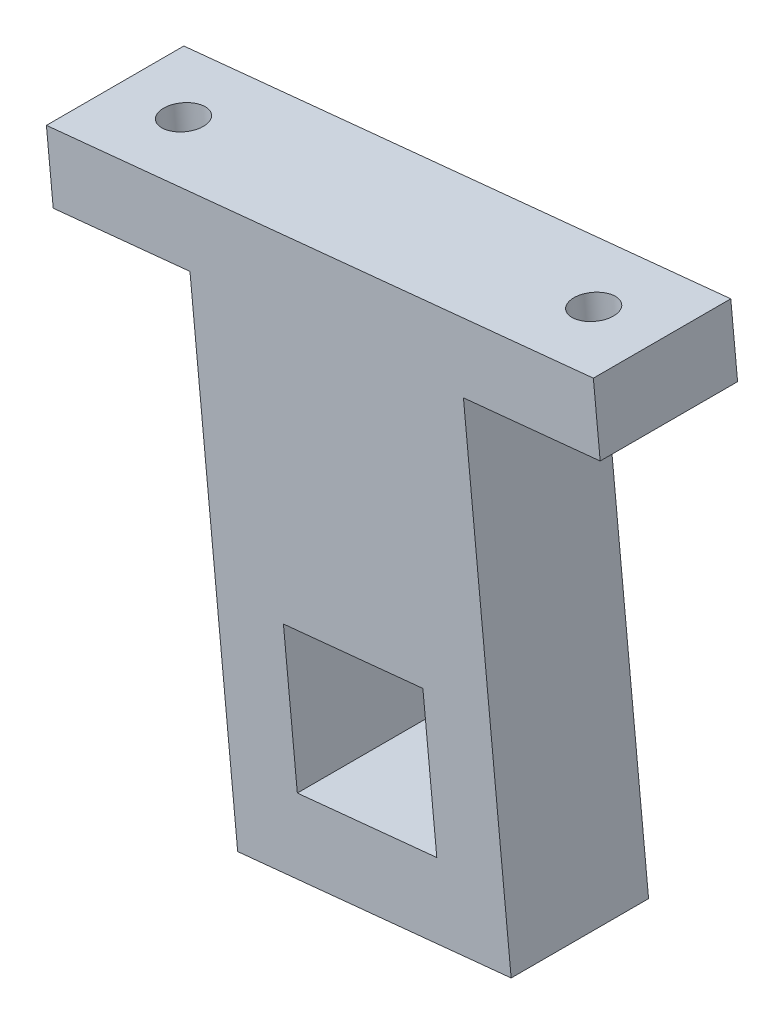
ISO-10303-21;
HEADER;
FILE_DESCRIPTION(('STEP AP214'),'2;1');
FILE_NAME('part.step','',(''),(''),'','','');
FILE_SCHEMA(('AUTOMOTIVE_DESIGN { 1 0 10303 214 1 1 1 1 }'));
ENDSEC;
DATA;
#1=APPLICATION_CONTEXT('core data for automotive mechanical design processes');
#2=APPLICATION_PROTOCOL_DEFINITION('international standard','automotive_design',2000,#1);
#3=PRODUCT_CONTEXT('',#1,'mechanical');
#4=PRODUCT('Part','Part','',(#3));
#5=PRODUCT_RELATED_PRODUCT_CATEGORY('part','',(#4));
#6=PRODUCT_DEFINITION_FORMATION('','',#4);
#7=PRODUCT_DEFINITION_CONTEXT('part definition',#1,'design');
#8=PRODUCT_DEFINITION('design','',#6,#7);
#9=PRODUCT_DEFINITION_SHAPE('','',#8);
#10=(LENGTH_UNIT() NAMED_UNIT(*) SI_UNIT(.MILLI.,.METRE.));
#11=(NAMED_UNIT(*) PLANE_ANGLE_UNIT() SI_UNIT($,.RADIAN.));
#12=(NAMED_UNIT(*) SI_UNIT($,.STERADIAN.) SOLID_ANGLE_UNIT());
#13=UNCERTAINTY_MEASURE_WITH_UNIT(LENGTH_MEASURE(1.E-05),#10,'distance_accuracy_value','');
#14=(GEOMETRIC_REPRESENTATION_CONTEXT(3) GLOBAL_UNCERTAINTY_ASSIGNED_CONTEXT((#13)) GLOBAL_UNIT_ASSIGNED_CONTEXT((#10,
#11,#12)) REPRESENTATION_CONTEXT('',''));
#15=CARTESIAN_POINT('',(0.,0.,0.));
#16=DIRECTION('',(0.,0.,1.));
#17=DIRECTION('',(1.,0.,0.));
#18=AXIS2_PLACEMENT_3D('',#15,#16,#17);
#19=CARTESIAN_POINT('',(0.,0.,10.));
#20=DIRECTION('',(0.,0.,-1.));
#21=DIRECTION('',(-1.,0.,0.));
#22=AXIS2_PLACEMENT_3D('',#19,#20,#21);
#23=PLANE('',#22);
#24=DIRECTION('',(0.995063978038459,0.0992354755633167,0.));
#25=VECTOR('',#24,1.);
#26=CARTESIAN_POINT('',(74.9791425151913,-167.604042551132,10.));
#27=LINE('',#26,#25);
#28=CARTESIAN_POINT('',(74.9791425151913,-167.604042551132,10.));
#29=VERTEX_POINT('',#28);
#30=CARTESIAN_POINT('',(84.9297822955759,-166.611687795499,10.));
#31=VERTEX_POINT('',#30);
#32=EDGE_CURVE('E187',#29,#31,#27,.T.);
#33=ORIENTED_EDGE('',*,*,#32,.T.);
#34=DIRECTION('',(0.0992354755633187,-0.995063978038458,0.));
#35=VECTOR('',#34,1.);
#36=CARTESIAN_POINT('',(84.9297822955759,-166.611687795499,10.));
#37=LINE('',#36,#35);
#38=CARTESIAN_POINT('',(88.4030239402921,-201.438927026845,10.));
#39=VERTEX_POINT('',#38);
#40=EDGE_CURVE('E191',#31,#39,#37,.T.);
#41=ORIENTED_EDGE('',*,*,#40,.T.);
#42=DIRECTION('',(0.995063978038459,0.0992354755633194,0.));
#43=VECTOR('',#42,1.);
#44=CARTESIAN_POINT('',(108.304303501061,-199.454217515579,10.));
#45=LINE('',#44,#43);
#46=CARTESIAN_POINT('',(108.304303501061,-199.454217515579,10.));
#47=VERTEX_POINT('',#46);
#48=EDGE_CURVE('E195',#39,#47,#45,.T.);
#49=ORIENTED_EDGE('',*,*,#48,.T.);
#50=DIRECTION('',(-0.0992354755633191,0.995063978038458,0.));
#51=VECTOR('',#50,1.);
#52=CARTESIAN_POINT('',(104.831061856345,-164.626978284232,10.));
#53=LINE('',#52,#51);
#54=CARTESIAN_POINT('',(104.831061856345,-164.626978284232,10.));
#55=VERTEX_POINT('',#54);
#56=EDGE_CURVE('E198',#47,#55,#53,.T.);
#57=ORIENTED_EDGE('',*,*,#56,.T.);
#58=DIRECTION('',(0.995063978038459,0.0992354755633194,0.));
#59=VECTOR('',#58,1.);
#60=CARTESIAN_POINT('',(114.78170163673,-163.634623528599,10.));
#61=LINE('',#60,#59);
#62=CARTESIAN_POINT('',(114.78170163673,-163.634623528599,10.));
#63=VERTEX_POINT('',#62);
#64=EDGE_CURVE('E201',#55,#63,#61,.T.);
#65=ORIENTED_EDGE('',*,*,#64,.T.);
#66=DIRECTION('',(-0.0992354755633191,0.995063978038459,0.));
#67=VECTOR('',#66,1.);
#68=CARTESIAN_POINT('',(114.285524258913,-158.659303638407,10.));
#69=LINE('',#68,#67);
#70=CARTESIAN_POINT('',(114.285524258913,-158.659303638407,10.));
#71=VERTEX_POINT('',#70);
#72=EDGE_CURVE('E204',#63,#71,#69,.T.);
#73=ORIENTED_EDGE('',*,*,#72,.T.);
#74=DIRECTION('',(-0.995063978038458,-0.099235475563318,0.));
#75=VECTOR('',#74,1.);
#76=CARTESIAN_POINT('',(114.285524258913,-158.659303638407,10.));
#77=LINE('',#76,#75);
#78=CARTESIAN_POINT('',(74.4829651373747,-162.62872266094,10.));
#79=VERTEX_POINT('',#78);
#80=EDGE_CURVE('E207',#71,#79,#77,.T.);
#81=ORIENTED_EDGE('',*,*,#80,.T.);
#82=DIRECTION('',(0.0992354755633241,-0.995063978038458,0.));
#83=VECTOR('',#82,1.);
#84=CARTESIAN_POINT('',(74.4829651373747,-162.62872266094,10.));
#85=LINE('',#84,#83);
#86=EDGE_CURVE('E210',#79,#29,#85,.T.);
#87=ORIENTED_EDGE('',*,*,#86,.T.);
#88=EDGE_LOOP('',(#33,#41,#49,#57,#65,#73,#81,#87));
#89=FACE_BOUND('',#88,.T.);
#90=DIRECTION('',(-0.995063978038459,-0.0992354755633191,0.));
#91=VECTOR('',#90,1.);
#92=CARTESIAN_POINT('',(101.880416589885,-184.417473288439,10.));
#93=LINE('',#92,#91);
#94=CARTESIAN_POINT('',(101.880416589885,-184.417473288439,10.));
#95=VERTEX_POINT('',#94);
#96=CARTESIAN_POINT('',(91.7307640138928,-185.429675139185,10.));
#97=VERTEX_POINT('',#96);
#98=EDGE_CURVE('E137',#95,#97,#93,.T.);
#99=ORIENTED_EDGE('',*,*,#98,.F.);
#100=DIRECTION('',(-0.0992354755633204,0.995063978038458,0.));
#101=VECTOR('',#100,1.);
#102=CARTESIAN_POINT('',(102.892618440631,-194.567125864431,10.));
#103=LINE('',#102,#101);
#104=CARTESIAN_POINT('',(102.892618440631,-194.567125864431,10.));
#105=VERTEX_POINT('',#104);
#106=EDGE_CURVE('E163',#105,#95,#103,.T.);
#107=ORIENTED_EDGE('',*,*,#106,.F.);
#108=DIRECTION('',(0.995063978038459,0.0992354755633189,0.));
#109=VECTOR('',#108,1.);
#110=CARTESIAN_POINT('',(92.7429658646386,-195.579327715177,10.));
#111=LINE('',#110,#109);
#112=CARTESIAN_POINT('',(92.7429658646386,-195.579327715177,10.));
#113=VERTEX_POINT('',#112);
#114=EDGE_CURVE('E159',#113,#105,#111,.T.);
#115=ORIENTED_EDGE('',*,*,#114,.F.);
#116=DIRECTION('',(0.0992354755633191,-0.995063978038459,0.));
#117=VECTOR('',#116,1.);
#118=CARTESIAN_POINT('',(92.7429658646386,-195.579327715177,10.));
#119=LINE('',#118,#117);
#120=EDGE_CURVE('E146',#97,#113,#119,.T.);
#121=ORIENTED_EDGE('',*,*,#120,.F.);
#122=EDGE_LOOP('',(#99,#107,#115,#121));
#123=FACE_BOUND('',#122,.T.);
#124=ADVANCED_FACE('F45',(#89,#123),#23,.F.);
#125=CARTESIAN_POINT('',(0.,0.,0.));
#126=DIRECTION('',(0.,0.,-1.));
#127=DIRECTION('',(-1.,0.,0.));
#128=AXIS2_PLACEMENT_3D('',#125,#126,#127);
#129=PLANE('',#128);
#130=DIRECTION('',(0.995063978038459,0.0992354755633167,0.));
#131=VECTOR('',#130,1.);
#132=CARTESIAN_POINT('',(74.9791425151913,-167.604042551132,0.));
#133=LINE('',#132,#131);
#134=CARTESIAN_POINT('',(74.9791425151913,-167.604042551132,0.));
#135=VERTEX_POINT('',#134);
#136=CARTESIAN_POINT('',(84.9297822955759,-166.611687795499,0.));
#137=VERTEX_POINT('',#136);
#138=EDGE_CURVE('E155',#135,#137,#133,.T.);
#139=ORIENTED_EDGE('',*,*,#138,.F.);
#140=DIRECTION('',(0.0992354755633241,-0.995063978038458,0.));
#141=VECTOR('',#140,1.);
#142=CARTESIAN_POINT('',(74.4829651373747,-162.62872266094,0.));
#143=LINE('',#142,#141);
#144=CARTESIAN_POINT('',(74.4829651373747,-162.62872266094,0.));
#145=VERTEX_POINT('',#144);
#146=EDGE_CURVE('E192',#145,#135,#143,.T.);
#147=ORIENTED_EDGE('',*,*,#146,.F.);
#148=DIRECTION('',(-0.995063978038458,-0.099235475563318,0.));
#149=VECTOR('',#148,1.);
#150=CARTESIAN_POINT('',(114.285524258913,-158.659303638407,0.));
#151=LINE('',#150,#149);
#152=CARTESIAN_POINT('',(114.285524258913,-158.659303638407,0.));
#153=VERTEX_POINT('',#152);
#154=EDGE_CURVE('E232',#153,#145,#151,.T.);
#155=ORIENTED_EDGE('',*,*,#154,.F.);
#156=DIRECTION('',(-0.0992354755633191,0.995063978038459,0.));
#157=VECTOR('',#156,1.);
#158=CARTESIAN_POINT('',(114.285524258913,-158.659303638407,0.));
#159=LINE('',#158,#157);
#160=CARTESIAN_POINT('',(114.78170163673,-163.634623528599,0.));
#161=VERTEX_POINT('',#160);
#162=EDGE_CURVE('E229',#161,#153,#159,.T.);
#163=ORIENTED_EDGE('',*,*,#162,.F.);
#164=DIRECTION('',(0.995063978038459,0.0992354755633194,0.));
#165=VECTOR('',#164,1.);
#166=CARTESIAN_POINT('',(114.78170163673,-163.634623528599,0.));
#167=LINE('',#166,#165);
#168=CARTESIAN_POINT('',(104.831061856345,-164.626978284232,0.));
#169=VERTEX_POINT('',#168);
#170=EDGE_CURVE('E226',#169,#161,#167,.T.);
#171=ORIENTED_EDGE('',*,*,#170,.F.);
#172=DIRECTION('',(-0.0992354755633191,0.995063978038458,0.));
#173=VECTOR('',#172,1.);
#174=CARTESIAN_POINT('',(104.831061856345,-164.626978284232,0.));
#175=LINE('',#174,#173);
#176=CARTESIAN_POINT('',(108.304303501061,-199.454217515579,0.));
#177=VERTEX_POINT('',#176);
#178=EDGE_CURVE('E223',#177,#169,#175,.T.);
#179=ORIENTED_EDGE('',*,*,#178,.F.);
#180=DIRECTION('',(0.995063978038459,0.0992354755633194,0.));
#181=VECTOR('',#180,1.);
#182=CARTESIAN_POINT('',(108.304303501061,-199.454217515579,0.));
#183=LINE('',#182,#181);
#184=CARTESIAN_POINT('',(88.4030239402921,-201.438927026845,0.));
#185=VERTEX_POINT('',#184);
#186=EDGE_CURVE('E220',#185,#177,#183,.T.);
#187=ORIENTED_EDGE('',*,*,#186,.F.);
#188=DIRECTION('',(0.0992354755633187,-0.995063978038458,0.));
#189=VECTOR('',#188,1.);
#190=CARTESIAN_POINT('',(84.9297822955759,-166.611687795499,0.));
#191=LINE('',#190,#189);
#192=EDGE_CURVE('E217',#137,#185,#191,.T.);
#193=ORIENTED_EDGE('',*,*,#192,.F.);
#194=EDGE_LOOP('',(#139,#147,#155,#163,#171,#179,#187,#193));
#195=FACE_BOUND('',#194,.T.);
#196=DIRECTION('',(-0.0992354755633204,0.995063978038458,0.));
#197=VECTOR('',#196,1.);
#198=CARTESIAN_POINT('',(102.892618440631,-194.567125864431,0.));
#199=LINE('',#198,#197);
#200=CARTESIAN_POINT('',(102.892618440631,-194.567125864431,0.));
#201=VERTEX_POINT('',#200);
#202=CARTESIAN_POINT('',(101.880416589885,-184.417473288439,0.));
#203=VERTEX_POINT('',#202);
#204=EDGE_CURVE('E147',#201,#203,#199,.T.);
#205=ORIENTED_EDGE('',*,*,#204,.T.);
#206=DIRECTION('',(-0.995063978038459,-0.0992354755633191,0.));
#207=VECTOR('',#206,1.);
#208=CARTESIAN_POINT('',(101.880416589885,-184.417473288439,0.));
#209=LINE('',#208,#207);
#210=CARTESIAN_POINT('',(91.7307640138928,-185.429675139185,0.));
#211=VERTEX_POINT('',#210);
#212=EDGE_CURVE('E71',#203,#211,#209,.T.);
#213=ORIENTED_EDGE('',*,*,#212,.T.);
#214=DIRECTION('',(0.0992354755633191,-0.995063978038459,0.));
#215=VECTOR('',#214,1.);
#216=CARTESIAN_POINT('',(92.7429658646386,-195.579327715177,0.));
#217=LINE('',#216,#215);
#218=CARTESIAN_POINT('',(92.7429658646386,-195.579327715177,0.));
#219=VERTEX_POINT('',#218);
#220=EDGE_CURVE('E153',#211,#219,#217,.T.);
#221=ORIENTED_EDGE('',*,*,#220,.T.);
#222=DIRECTION('',(0.995063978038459,0.0992354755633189,0.));
#223=VECTOR('',#222,1.);
#224=CARTESIAN_POINT('',(92.7429658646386,-195.579327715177,0.));
#225=LINE('',#224,#223);
#226=EDGE_CURVE('E174',#219,#201,#225,.T.);
#227=ORIENTED_EDGE('',*,*,#226,.T.);
#228=EDGE_LOOP('',(#205,#213,#221,#227));
#229=FACE_BOUND('',#228,.T.);
#230=ADVANCED_FACE('F290',(#195,#229),#129,.T.);
#231=CARTESIAN_POINT('',(74.9791425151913,-167.604042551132,10.));
#232=DIRECTION('',(-0.0992354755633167,0.995063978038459,0.));
#233=DIRECTION('',(-0.995063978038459,-0.0992354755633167,0.));
#234=AXIS2_PLACEMENT_3D('',#231,#232,#233);
#235=PLANE('',#234);
#236=CARTESIAN_POINT('',(79.9544624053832,-167.107865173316,5.));
#237=DIRECTION('',(0.0992354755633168,-0.995063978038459,0.));
#238=DIRECTION('',(0.995063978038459,0.0992354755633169,0.));
#239=AXIS2_PLACEMENT_3D('',#236,#237,#238);
#240=CIRCLE('',#239,2.75);
#241=CARTESIAN_POINT('',(82.690888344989,-166.834967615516,5.));
#242=VERTEX_POINT('',#241);
#243=EDGE_CURVE('E280',#242,#242,#240,.T.);
#244=ORIENTED_EDGE('',*,*,#243,.F.);
#245=EDGE_LOOP('',(#244));
#246=FACE_BOUND('',#245,.T.);
#247=ORIENTED_EDGE('',*,*,#138,.T.);
#248=DIRECTION('',(0.,0.,-1.));
#249=VECTOR('',#248,1.);
#250=CARTESIAN_POINT('',(84.9297822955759,-166.611687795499,10.));
#251=LINE('',#250,#249);
#252=EDGE_CURVE('E11',#31,#137,#251,.T.);
#253=ORIENTED_EDGE('',*,*,#252,.F.);
#254=ORIENTED_EDGE('',*,*,#32,.F.);
#255=DIRECTION('',(0.,0.,-1.));
#256=VECTOR('',#255,1.);
#257=CARTESIAN_POINT('',(74.9791425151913,-167.604042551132,10.));
#258=LINE('',#257,#256);
#259=EDGE_CURVE('E213',#29,#135,#258,.T.);
#260=ORIENTED_EDGE('',*,*,#259,.T.);
#261=EDGE_LOOP('',(#247,#253,#254,#260));
#262=FACE_BOUND('',#261,.T.);
#263=ADVANCED_FACE('F47',(#246,#262),#235,.F.);
#264=CARTESIAN_POINT('',(84.9297822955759,-166.611687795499,10.));
#265=DIRECTION('',(0.995063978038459,0.0992354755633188,0.));
#266=DIRECTION('',(-0.0992354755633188,0.995063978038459,0.));
#267=AXIS2_PLACEMENT_3D('',#264,#265,#266);
#268=PLANE('',#267);
#269=ORIENTED_EDGE('',*,*,#192,.T.);
#270=DIRECTION('',(0.,0.,-1.));
#271=VECTOR('',#270,1.);
#272=CARTESIAN_POINT('',(88.4030239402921,-201.438927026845,10.));
#273=LINE('',#272,#271);
#274=EDGE_CURVE('E55',#39,#185,#273,.T.);
#275=ORIENTED_EDGE('',*,*,#274,.F.);
#276=ORIENTED_EDGE('',*,*,#40,.F.);
#277=ORIENTED_EDGE('',*,*,#252,.T.);
#278=EDGE_LOOP('',(#269,#275,#276,#277));
#279=FACE_BOUND('',#278,.T.);
#280=ADVANCED_FACE('F289',(#279),#268,.F.);
#281=CARTESIAN_POINT('',(108.304303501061,-199.454217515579,10.));
#282=DIRECTION('',(-0.0992354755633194,0.995063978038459,0.));
#283=DIRECTION('',(-0.995063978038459,-0.0992354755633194,0.));
#284=AXIS2_PLACEMENT_3D('',#281,#282,#283);
#285=PLANE('',#284);
#286=ORIENTED_EDGE('',*,*,#186,.T.);
#287=DIRECTION('',(0.,0.,-1.));
#288=VECTOR('',#287,1.);
#289=CARTESIAN_POINT('',(108.304303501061,-199.454217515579,10.));
#290=LINE('',#289,#288);
#291=EDGE_CURVE('E256',#47,#177,#290,.T.);
#292=ORIENTED_EDGE('',*,*,#291,.F.);
#293=ORIENTED_EDGE('',*,*,#48,.F.);
#294=ORIENTED_EDGE('',*,*,#274,.T.);
#295=EDGE_LOOP('',(#286,#292,#293,#294));
#296=FACE_BOUND('',#295,.T.);
#297=ADVANCED_FACE('F328',(#296),#285,.F.);
#298=CARTESIAN_POINT('',(104.831061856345,-164.626978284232,10.));
#299=DIRECTION('',(-0.995063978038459,-0.0992354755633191,0.));
#300=DIRECTION('',(0.0992354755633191,-0.995063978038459,0.));
#301=AXIS2_PLACEMENT_3D('',#298,#299,#300);
#302=PLANE('',#301);
#303=ORIENTED_EDGE('',*,*,#178,.T.);
#304=DIRECTION('',(0.,0.,-1.));
#305=VECTOR('',#304,1.);
#306=CARTESIAN_POINT('',(104.831061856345,-164.626978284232,10.));
#307=LINE('',#306,#305);
#308=EDGE_CURVE('E252',#55,#169,#307,.T.);
#309=ORIENTED_EDGE('',*,*,#308,.F.);
#310=ORIENTED_EDGE('',*,*,#56,.F.);
#311=ORIENTED_EDGE('',*,*,#291,.T.);
#312=EDGE_LOOP('',(#303,#309,#310,#311));
#313=FACE_BOUND('',#312,.T.);
#314=ADVANCED_FACE('F325',(#313),#302,.F.);
#315=CARTESIAN_POINT('',(114.78170163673,-163.634623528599,10.));
#316=DIRECTION('',(-0.0992354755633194,0.995063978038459,0.));
#317=DIRECTION('',(-0.995063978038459,-0.0992354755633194,0.));
#318=AXIS2_PLACEMENT_3D('',#315,#316,#317);
#319=PLANE('',#318);
#320=CARTESIAN_POINT('',(109.806381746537,-164.130800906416,5.));
#321=DIRECTION('',(0.0992354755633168,-0.995063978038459,0.));
#322=DIRECTION('',(0.995063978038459,0.0992354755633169,0.));
#323=AXIS2_PLACEMENT_3D('',#320,#321,#322);
#324=CIRCLE('',#323,2.75);
#325=CARTESIAN_POINT('',(112.542807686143,-163.857903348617,5.));
#326=VERTEX_POINT('',#325);
#327=EDGE_CURVE('E269',#326,#326,#324,.T.);
#328=ORIENTED_EDGE('',*,*,#327,.F.);
#329=EDGE_LOOP('',(#328));
#330=FACE_BOUND('',#329,.T.);
#331=ORIENTED_EDGE('',*,*,#170,.T.);
#332=DIRECTION('',(0.,0.,-1.));
#333=VECTOR('',#332,1.);
#334=CARTESIAN_POINT('',(114.78170163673,-163.634623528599,10.));
#335=LINE('',#334,#333);
#336=EDGE_CURVE('E248',#63,#161,#335,.T.);
#337=ORIENTED_EDGE('',*,*,#336,.F.);
#338=ORIENTED_EDGE('',*,*,#64,.F.);
#339=ORIENTED_EDGE('',*,*,#308,.T.);
#340=EDGE_LOOP('',(#331,#337,#338,#339));
#341=FACE_BOUND('',#340,.T.);
#342=ADVANCED_FACE('F321',(#330,#341),#319,.F.);
#343=CARTESIAN_POINT('',(114.285524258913,-158.659303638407,10.));
#344=DIRECTION('',(-0.995063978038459,-0.0992354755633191,0.));
#345=DIRECTION('',(0.0992354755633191,-0.995063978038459,0.));
#346=AXIS2_PLACEMENT_3D('',#343,#344,#345);
#347=PLANE('',#346);
#348=ORIENTED_EDGE('',*,*,#162,.T.);
#349=DIRECTION('',(0.,0.,-1.));
#350=VECTOR('',#349,1.);
#351=CARTESIAN_POINT('',(114.285524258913,-158.659303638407,10.));
#352=LINE('',#351,#350);
#353=EDGE_CURVE('E244',#71,#153,#352,.T.);
#354=ORIENTED_EDGE('',*,*,#353,.F.);
#355=ORIENTED_EDGE('',*,*,#72,.F.);
#356=ORIENTED_EDGE('',*,*,#336,.T.);
#357=EDGE_LOOP('',(#348,#354,#355,#356));
#358=FACE_BOUND('',#357,.T.);
#359=ADVANCED_FACE('F316',(#358),#347,.F.);
#360=CARTESIAN_POINT('',(114.285524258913,-158.659303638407,10.));
#361=DIRECTION('',(0.099235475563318,-0.995063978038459,0.));
#362=DIRECTION('',(0.995063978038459,0.099235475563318,0.));
#363=AXIS2_PLACEMENT_3D('',#360,#361,#362);
#364=PLANE('',#363);
#365=CARTESIAN_POINT('',(79.4582850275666,-162.132545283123,5.));
#366=DIRECTION('',(0.099235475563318,-0.995063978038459,0.));
#367=DIRECTION('',(0.995063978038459,0.099235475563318,0.));
#368=AXIS2_PLACEMENT_3D('',#365,#366,#367);
#369=CIRCLE('',#368,1.45);
#370=CARTESIAN_POINT('',(80.9011277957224,-161.988653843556,5.));
#371=VERTEX_POINT('',#370);
#372=EDGE_CURVE('E49',#371,#371,#369,.T.);
#373=ORIENTED_EDGE('',*,*,#372,.T.);
#374=EDGE_LOOP('',(#373));
#375=FACE_BOUND('',#374,.T.);
#376=CARTESIAN_POINT('',(109.31020436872,-159.155481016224,5.));
#377=DIRECTION('',(0.099235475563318,-0.995063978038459,0.));
#378=DIRECTION('',(0.995063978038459,0.099235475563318,0.));
#379=AXIS2_PLACEMENT_3D('',#376,#377,#378);
#380=CIRCLE('',#379,1.45);
#381=CARTESIAN_POINT('',(110.753047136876,-159.011589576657,5.));
#382=VERTEX_POINT('',#381);
#383=EDGE_CURVE('E171',#382,#382,#380,.T.);
#384=ORIENTED_EDGE('',*,*,#383,.T.);
#385=EDGE_LOOP('',(#384));
#386=FACE_BOUND('',#385,.T.);
#387=ORIENTED_EDGE('',*,*,#154,.T.);
#388=DIRECTION('',(0.,0.,-1.));
#389=VECTOR('',#388,1.);
#390=CARTESIAN_POINT('',(74.4829651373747,-162.62872266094,10.));
#391=LINE('',#390,#389);
#392=EDGE_CURVE('E240',#79,#145,#391,.T.);
#393=ORIENTED_EDGE('',*,*,#392,.F.);
#394=ORIENTED_EDGE('',*,*,#80,.F.);
#395=ORIENTED_EDGE('',*,*,#353,.T.);
#396=EDGE_LOOP('',(#387,#393,#394,#395));
#397=FACE_BOUND('',#396,.T.);
#398=ADVANCED_FACE('F311',(#375,#386,#397),#364,.F.);
#399=CARTESIAN_POINT('',(74.4829651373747,-162.62872266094,10.));
#400=DIRECTION('',(0.995063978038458,0.0992354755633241,0.));
#401=DIRECTION('',(-0.0992354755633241,0.995063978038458,0.));
#402=AXIS2_PLACEMENT_3D('',#399,#400,#401);
#403=PLANE('',#402);
#404=ORIENTED_EDGE('',*,*,#146,.T.);
#405=ORIENTED_EDGE('',*,*,#259,.F.);
#406=ORIENTED_EDGE('',*,*,#86,.F.);
#407=ORIENTED_EDGE('',*,*,#392,.T.);
#408=EDGE_LOOP('',(#404,#405,#406,#407));
#409=FACE_BOUND('',#408,.T.);
#410=ADVANCED_FACE('F309',(#409),#403,.F.);
#411=CARTESIAN_POINT('',(101.880416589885,-184.417473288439,10.));
#412=DIRECTION('',(0.0992354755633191,-0.995063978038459,0.));
#413=DIRECTION('',(0.995063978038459,0.0992354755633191,0.));
#414=AXIS2_PLACEMENT_3D('',#411,#412,#413);
#415=PLANE('',#414);
#416=ORIENTED_EDGE('',*,*,#212,.F.);
#417=DIRECTION('',(0.,0.,-1.));
#418=VECTOR('',#417,1.);
#419=CARTESIAN_POINT('',(101.880416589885,-184.417473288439,10.));
#420=LINE('',#419,#418);
#421=EDGE_CURVE('E141',#95,#203,#420,.T.);
#422=ORIENTED_EDGE('',*,*,#421,.F.);
#423=ORIENTED_EDGE('',*,*,#98,.T.);
#424=DIRECTION('',(0.,0.,-1.));
#425=VECTOR('',#424,1.);
#426=CARTESIAN_POINT('',(91.7307640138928,-185.429675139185,10.));
#427=LINE('',#426,#425);
#428=EDGE_CURVE('E140',#97,#211,#427,.T.);
#429=ORIENTED_EDGE('',*,*,#428,.T.);
#430=EDGE_LOOP('',(#416,#422,#423,#429));
#431=FACE_BOUND('',#430,.T.);
#432=ADVANCED_FACE('F139',(#431),#415,.T.);
#433=CARTESIAN_POINT('',(92.7429658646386,-195.579327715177,10.));
#434=DIRECTION('',(0.995063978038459,0.0992354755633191,0.));
#435=DIRECTION('',(-0.0992354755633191,0.995063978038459,0.));
#436=AXIS2_PLACEMENT_3D('',#433,#434,#435);
#437=PLANE('',#436);
#438=ORIENTED_EDGE('',*,*,#220,.F.);
#439=ORIENTED_EDGE('',*,*,#428,.F.);
#440=ORIENTED_EDGE('',*,*,#120,.T.);
#441=DIRECTION('',(0.,0.,-1.));
#442=VECTOR('',#441,1.);
#443=CARTESIAN_POINT('',(92.7429658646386,-195.579327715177,10.));
#444=LINE('',#443,#442);
#445=EDGE_CURVE('E156',#113,#219,#444,.T.);
#446=ORIENTED_EDGE('',*,*,#445,.T.);
#447=EDGE_LOOP('',(#438,#439,#440,#446));
#448=FACE_BOUND('',#447,.T.);
#449=ADVANCED_FACE('F150',(#448),#437,.T.);
#450=CARTESIAN_POINT('',(92.7429658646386,-195.579327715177,10.));
#451=DIRECTION('',(-0.0992354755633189,0.995063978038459,0.));
#452=DIRECTION('',(-0.995063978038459,-0.0992354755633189,0.));
#453=AXIS2_PLACEMENT_3D('',#450,#451,#452);
#454=PLANE('',#453);
#455=ORIENTED_EDGE('',*,*,#226,.F.);
#456=ORIENTED_EDGE('',*,*,#445,.F.);
#457=ORIENTED_EDGE('',*,*,#114,.T.);
#458=DIRECTION('',(0.,0.,-1.));
#459=VECTOR('',#458,1.);
#460=CARTESIAN_POINT('',(102.892618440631,-194.567125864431,10.));
#461=LINE('',#460,#459);
#462=EDGE_CURVE('E63',#105,#201,#461,.T.);
#463=ORIENTED_EDGE('',*,*,#462,.T.);
#464=EDGE_LOOP('',(#455,#456,#457,#463));
#465=FACE_BOUND('',#464,.T.);
#466=ADVANCED_FACE('F376',(#465),#454,.T.);
#467=CARTESIAN_POINT('',(102.892618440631,-194.567125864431,10.));
#468=DIRECTION('',(-0.995063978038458,-0.0992354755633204,0.));
#469=DIRECTION('',(0.0992354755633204,-0.995063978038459,0.));
#470=AXIS2_PLACEMENT_3D('',#467,#468,#469);
#471=PLANE('',#470);
#472=ORIENTED_EDGE('',*,*,#204,.F.);
#473=ORIENTED_EDGE('',*,*,#462,.F.);
#474=ORIENTED_EDGE('',*,*,#106,.T.);
#475=ORIENTED_EDGE('',*,*,#421,.T.);
#476=EDGE_LOOP('',(#472,#473,#474,#475));
#477=FACE_BOUND('',#476,.T.);
#478=ADVANCED_FACE('F370',(#477),#471,.T.);
#479=CARTESIAN_POINT('',(109.806381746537,-164.130800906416,5.));
#480=DIRECTION('',(0.0992354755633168,-0.995063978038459,0.));
#481=DIRECTION('',(0.995063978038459,0.0992354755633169,0.));
#482=AXIS2_PLACEMENT_3D('',#479,#480,#481);
#483=CYLINDRICAL_SURFACE('',#482,1.45);
#484=CARTESIAN_POINT('',(109.677375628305,-162.837217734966,5.));
#485=DIRECTION('',(0.0992354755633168,-0.995063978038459,0.));
#486=DIRECTION('',(0.995063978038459,0.0992354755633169,0.));
#487=AXIS2_PLACEMENT_3D('',#484,#485,#486);
#488=CIRCLE('',#487,1.45);
#489=CARTESIAN_POINT('',(111.12021839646,-162.693326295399,5.));
#490=VERTEX_POINT('',#489);
#491=EDGE_CURVE('E264',#490,#490,#488,.T.);
#492=CARTESIAN_POINT('',(111.12021839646,-162.693326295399,5.));
#493=CARTESIAN_POINT('',(111.11639369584,-162.654974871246,5.));
#494=CARTESIAN_POINT('',(111.112568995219,-162.616623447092,5.));
#495=CARTESIAN_POINT('',(111.104919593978,-162.539920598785,5.));
#496=CARTESIAN_POINT('',(111.101094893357,-162.501569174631,5.));
#497=CARTESIAN_POINT('',(111.093445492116,-162.424866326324,5.));
#498=CARTESIAN_POINT('',(111.089620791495,-162.386514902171,5.));
#499=CARTESIAN_POINT('',(111.081971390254,-162.309812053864,5.));
#500=CARTESIAN_POINT('',(111.078146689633,-162.27146062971,5.));
#501=CARTESIAN_POINT('',(111.070497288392,-162.194757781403,5.));
#502=CARTESIAN_POINT('',(111.066672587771,-162.156406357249,5.));
#503=CARTESIAN_POINT('',(111.05902318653,-162.079703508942,5.));
#504=CARTESIAN_POINT('',(111.055198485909,-162.041352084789,5.));
#505=CARTESIAN_POINT('',(111.047549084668,-161.964649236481,5.));
#506=CARTESIAN_POINT('',(111.043724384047,-161.926297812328,5.));
#507=CARTESIAN_POINT('',(111.036074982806,-161.849594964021,5.));
#508=CARTESIAN_POINT('',(111.032250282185,-161.811243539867,5.));
#509=CARTESIAN_POINT('',(111.024600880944,-161.73454069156,5.));
#510=CARTESIAN_POINT('',(111.020776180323,-161.696189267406,5.));
#511=CARTESIAN_POINT('',(111.013126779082,-161.619486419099,5.));
#512=CARTESIAN_POINT('',(111.009302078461,-161.581134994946,5.));
#513=CARTESIAN_POINT('',(111.00165267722,-161.504432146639,5.));
#514=CARTESIAN_POINT('',(110.997827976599,-161.466080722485,5.));
#515=CARTESIAN_POINT('',(110.990178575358,-161.389377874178,5.));
#516=CARTESIAN_POINT('',(110.986353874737,-161.351026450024,5.));
#517=CARTESIAN_POINT('',(110.978704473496,-161.274323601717,5.));
#518=CARTESIAN_POINT('',(110.974879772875,-161.235972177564,5.));
#519=CARTESIAN_POINT('',(110.967230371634,-161.159269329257,5.));
#520=CARTESIAN_POINT('',(110.963405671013,-161.120917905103,5.));
#521=CARTESIAN_POINT('',(110.955756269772,-161.044215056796,5.));
#522=CARTESIAN_POINT('',(110.951931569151,-161.005863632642,5.));
#523=CARTESIAN_POINT('',(110.94428216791,-160.929160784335,5.));
#524=CARTESIAN_POINT('',(110.940457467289,-160.890809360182,5.));
#525=CARTESIAN_POINT('',(110.932808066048,-160.814106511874,5.));
#526=CARTESIAN_POINT('',(110.928983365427,-160.775755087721,5.));
#527=CARTESIAN_POINT('',(110.921333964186,-160.699052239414,5.));
#528=CARTESIAN_POINT('',(110.917509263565,-160.66070081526,5.));
#529=CARTESIAN_POINT('',(110.909859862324,-160.583997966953,5.));
#530=CARTESIAN_POINT('',(110.906035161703,-160.545646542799,5.));
#531=CARTESIAN_POINT('',(110.898385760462,-160.468943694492,5.));
#532=CARTESIAN_POINT('',(110.894561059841,-160.430592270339,5.));
#533=CARTESIAN_POINT('',(110.8869116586,-160.353889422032,5.));
#534=CARTESIAN_POINT('',(110.883086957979,-160.315537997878,5.));
#535=CARTESIAN_POINT('',(110.875437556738,-160.238835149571,5.));
#536=CARTESIAN_POINT('',(110.871612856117,-160.200483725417,5.));
#537=CARTESIAN_POINT('',(110.863963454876,-160.12378087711,5.));
#538=CARTESIAN_POINT('',(110.860138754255,-160.085429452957,5.));
#539=CARTESIAN_POINT('',(110.852489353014,-160.008726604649,5.));
#540=CARTESIAN_POINT('',(110.848664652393,-159.970375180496,5.));
#541=CARTESIAN_POINT('',(110.841015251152,-159.893672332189,5.));
#542=CARTESIAN_POINT('',(110.837190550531,-159.855320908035,5.));
#543=CARTESIAN_POINT('',(110.82954114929,-159.778618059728,5.));
#544=CARTESIAN_POINT('',(110.825716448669,-159.740266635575,5.));
#545=CARTESIAN_POINT('',(110.818067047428,-159.663563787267,5.));
#546=CARTESIAN_POINT('',(110.814242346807,-159.625212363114,5.));
#547=CARTESIAN_POINT('',(110.806592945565,-159.548509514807,5.));
#548=CARTESIAN_POINT('',(110.802768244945,-159.510158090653,5.));
#549=CARTESIAN_POINT('',(110.795118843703,-159.433455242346,5.));
#550=CARTESIAN_POINT('',(110.791294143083,-159.395103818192,5.));
#551=CARTESIAN_POINT('',(110.783644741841,-159.318400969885,5.));
#552=CARTESIAN_POINT('',(110.779820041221,-159.280049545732,5.));
#553=CARTESIAN_POINT('',(110.772170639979,-159.203346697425,5.));
#554=CARTESIAN_POINT('',(110.768345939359,-159.164995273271,5.));
#555=CARTESIAN_POINT('',(110.760696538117,-159.088292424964,5.));
#556=CARTESIAN_POINT('',(110.756871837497,-159.04994100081,5.));
#557=CARTESIAN_POINT('',(110.753047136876,-159.011589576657,5.));
#558=B_SPLINE_CURVE_WITH_KNOTS('',3,(#492,#493,#494,#495,#496,#497,#498,#499,#500,#501,#502,
#503,#504,#505,#506,#507,#508,#509,#510,#511,#512,#513,#514,#515,#516,#517,#518,#519,#520,#521,
#522,#523,#524,#525,#526,#527,#528,#529,#530,#531,#532,#533,#534,#535,#536,#537,#538,#539,#540,
#541,#542,#543,#544,#545,#546,#547,#548,#549,#550,#551,#552,#553,#554,#555,#556,#557),
.UNSPECIFIED.,.F.,.F.,(4,2,2,2,2,2,2,2,2,2,2,2,2,2,2,2,2,2,2,2,2,2,2,2,2,2,2,2,2,2,2,2,4),(0.,
0.115625,0.231249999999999,0.346874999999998,0.462499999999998,0.578124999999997,
0.693750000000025,0.809375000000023,0.925000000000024,1.04062500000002,1.15625000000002,
1.27187500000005,1.38750000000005,1.50312500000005,1.61875000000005,1.73437500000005,
1.85000000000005,1.96562500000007,2.08125000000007,2.19687500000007,2.31250000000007,
2.42812500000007,2.5437500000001,2.6593750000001,2.7750000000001,2.8906250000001,
3.0062500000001,3.12187500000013,3.23750000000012,3.35312500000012,3.46875000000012,
3.58437500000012,3.70000000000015),.UNSPECIFIED.);
#559=EDGE_CURVE('BSEAM361',#490,#382,#558,.T.);
#560=ORIENTED_EDGE('',*,*,#491,.T.);
#561=ORIENTED_EDGE('',*,*,#383,.F.);
#562=ORIENTED_EDGE('',*,*,#559,.T.);
#563=ORIENTED_EDGE('',*,*,#559,.F.);
#564=EDGE_LOOP('',(#560,#562,#561,#563));
#565=FACE_BOUND('',#564,.T.);
#566=ADVANCED_FACE('F361',(#565),#483,.F.);
#567=CARTESIAN_POINT('',(109.806381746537,-164.130800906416,5.));
#568=DIRECTION('',(0.0992354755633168,-0.995063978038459,0.));
#569=DIRECTION('',(0.995063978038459,0.0992354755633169,0.));
#570=AXIS2_PLACEMENT_3D('',#567,#568,#569);
#571=CONICAL_SURFACE('',#570,2.75,0.785398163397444);
#572=CARTESIAN_POINT('',(111.12021839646,-162.693326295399,5.));
#573=CARTESIAN_POINT('',(111.135037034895,-162.70545730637,5.));
#574=CARTESIAN_POINT('',(111.149855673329,-162.717588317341,5.));
#575=CARTESIAN_POINT('',(111.179492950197,-162.741850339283,5.));
#576=CARTESIAN_POINT('',(111.194311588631,-162.753981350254,5.));
#577=CARTESIAN_POINT('',(111.2239488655,-162.778243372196,5.));
#578=CARTESIAN_POINT('',(111.238767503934,-162.790374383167,5.));
#579=CARTESIAN_POINT('',(111.268404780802,-162.814636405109,5.));
#580=CARTESIAN_POINT('',(111.283223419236,-162.82676741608,5.));
#581=CARTESIAN_POINT('',(111.312860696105,-162.851029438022,5.));
#582=CARTESIAN_POINT('',(111.327679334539,-162.863160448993,5.));
#583=CARTESIAN_POINT('',(111.357316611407,-162.887422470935,5.));
#584=CARTESIAN_POINT('',(111.372135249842,-162.899553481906,5.));
#585=CARTESIAN_POINT('',(111.40177252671,-162.923815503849,5.));
#586=CARTESIAN_POINT('',(111.416591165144,-162.93594651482,5.));
#587=CARTESIAN_POINT('',(111.446228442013,-162.960208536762,5.));
#588=CARTESIAN_POINT('',(111.461047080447,-162.972339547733,5.));
#589=CARTESIAN_POINT('',(111.490684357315,-162.996601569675,5.));
#590=CARTESIAN_POINT('',(111.505502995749,-163.008732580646,5.));
#591=CARTESIAN_POINT('',(111.535140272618,-163.032994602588,5.));
#592=CARTESIAN_POINT('',(111.549958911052,-163.045125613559,5.));
#593=CARTESIAN_POINT('',(111.57959618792,-163.069387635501,5.));
#594=CARTESIAN_POINT('',(111.594414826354,-163.081518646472,5.));
#595=CARTESIAN_POINT('',(111.624052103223,-163.105780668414,5.));
#596=CARTESIAN_POINT('',(111.638870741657,-163.117911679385,5.));
#597=CARTESIAN_POINT('',(111.668508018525,-163.142173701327,5.));
#598=CARTESIAN_POINT('',(111.68332665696,-163.154304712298,5.));
#599=CARTESIAN_POINT('',(111.712963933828,-163.17856673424,5.));
#600=CARTESIAN_POINT('',(111.727782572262,-163.190697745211,5.));
#601=CARTESIAN_POINT('',(111.757419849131,-163.214959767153,5.));
#602=CARTESIAN_POINT('',(111.772238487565,-163.227090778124,5.));
#603=CARTESIAN_POINT('',(111.801875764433,-163.251352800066,5.));
#604=CARTESIAN_POINT('',(111.816694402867,-163.263483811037,5.));
#605=CARTESIAN_POINT('',(111.846331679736,-163.287745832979,5.));
#606=CARTESIAN_POINT('',(111.86115031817,-163.29987684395,5.));
#607=CARTESIAN_POINT('',(111.890787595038,-163.324138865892,5.));
#608=CARTESIAN_POINT('',(111.905606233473,-163.336269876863,5.));
#609=CARTESIAN_POINT('',(111.935243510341,-163.360531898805,5.));
#610=CARTESIAN_POINT('',(111.950062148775,-163.372662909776,5.));
#611=CARTESIAN_POINT('',(111.979699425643,-163.396924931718,5.));
#612=CARTESIAN_POINT('',(111.994518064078,-163.409055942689,5.));
#613=CARTESIAN_POINT('',(112.024155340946,-163.433317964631,5.));
#614=CARTESIAN_POINT('',(112.03897397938,-163.445448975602,5.));
#615=CARTESIAN_POINT('',(112.068611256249,-163.469710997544,5.));
#616=CARTESIAN_POINT('',(112.083429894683,-163.481842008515,5.));
#617=CARTESIAN_POINT('',(112.113067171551,-163.506104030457,5.));
#618=CARTESIAN_POINT('',(112.127885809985,-163.518235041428,5.));
#619=CARTESIAN_POINT('',(112.157523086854,-163.54249706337,5.));
#620=CARTESIAN_POINT('',(112.172341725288,-163.554628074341,5.));
#621=CARTESIAN_POINT('',(112.201979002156,-163.578890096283,5.));
#622=CARTESIAN_POINT('',(112.216797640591,-163.591021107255,5.));
#623=CARTESIAN_POINT('',(112.246434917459,-163.615283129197,5.));
#624=CARTESIAN_POINT('',(112.261253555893,-163.627414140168,5.));
#625=CARTESIAN_POINT('',(112.290890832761,-163.65167616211,5.));
#626=CARTESIAN_POINT('',(112.305709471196,-163.663807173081,5.));
#627=CARTESIAN_POINT('',(112.335346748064,-163.688069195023,5.));
#628=CARTESIAN_POINT('',(112.350165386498,-163.700200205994,5.));
#629=CARTESIAN_POINT('',(112.379802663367,-163.724462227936,5.));
#630=CARTESIAN_POINT('',(112.394621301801,-163.736593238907,5.));
#631=CARTESIAN_POINT('',(112.424258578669,-163.760855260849,5.));
#632=CARTESIAN_POINT('',(112.439077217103,-163.77298627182,5.));
#633=CARTESIAN_POINT('',(112.468714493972,-163.797248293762,5.));
#634=CARTESIAN_POINT('',(112.483533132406,-163.809379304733,5.));
#635=CARTESIAN_POINT('',(112.513170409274,-163.833641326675,5.));
#636=CARTESIAN_POINT('',(112.527989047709,-163.845772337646,5.));
#637=CARTESIAN_POINT('',(112.542807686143,-163.857903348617,5.));
#638=B_SPLINE_CURVE_WITH_KNOTS('',3,(#572,#573,#574,#575,#576,#577,#578,#579,#580,#581,#582,
#583,#584,#585,#586,#587,#588,#589,#590,#591,#592,#593,#594,#595,#596,#597,#598,#599,#600,#601,
#602,#603,#604,#605,#606,#607,#608,#609,#610,#611,#612,#613,#614,#615,#616,#617,#618,#619,#620,
#621,#622,#623,#624,#625,#626,#627,#628,#629,#630,#631,#632,#633,#634,#635,#636,#637),
.UNSPECIFIED.,.F.,.F.,(4,2,2,2,2,2,2,2,2,2,2,2,2,2,2,2,2,2,2,2,2,2,2,2,2,2,2,2,2,2,2,2,4),(0.,
0.0574524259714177,0.114904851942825,0.172357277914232,0.229809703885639,0.287262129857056,
0.344714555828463,0.40216698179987,0.459619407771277,0.517071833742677,0.574524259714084,
0.631976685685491,0.689429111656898,0.746881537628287,0.804333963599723,0.86178638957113,
0.919238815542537,0.976691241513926,1.03414366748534,1.09159609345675,1.14904851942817,
1.20650094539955,1.26395337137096,1.32140579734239,1.37885822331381,1.43631064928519,
1.4937630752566,1.55121550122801,1.60866792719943,1.66612035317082,1.72357277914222,
1.78102520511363,1.83847763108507),.UNSPECIFIED.);
#639=EDGE_CURVE('BSEAM358',#490,#326,#638,.T.);
#640=ORIENTED_EDGE('',*,*,#491,.F.);
#641=ORIENTED_EDGE('',*,*,#327,.T.);
#642=ORIENTED_EDGE('',*,*,#639,.T.);
#643=ORIENTED_EDGE('',*,*,#639,.F.);
#644=EDGE_LOOP('',(#640,#642,#641,#643));
#645=FACE_BOUND('',#644,.T.);
#646=ADVANCED_FACE('F358',(#645),#571,.F.);
#647=CARTESIAN_POINT('',(79.9544624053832,-167.107865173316,5.));
#648=DIRECTION('',(0.0992354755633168,-0.995063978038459,0.));
#649=DIRECTION('',(0.995063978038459,0.0992354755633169,0.));
#650=AXIS2_PLACEMENT_3D('',#647,#648,#649);
#651=CYLINDRICAL_SURFACE('',#650,1.45);
#652=CARTESIAN_POINT('',(79.8254562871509,-165.814282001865,5.));
#653=DIRECTION('',(0.0992354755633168,-0.995063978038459,0.));
#654=DIRECTION('',(0.995063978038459,0.0992354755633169,0.));
#655=AXIS2_PLACEMENT_3D('',#652,#653,#654);
#656=CIRCLE('',#655,1.45);
#657=CARTESIAN_POINT('',(81.2682990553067,-165.670390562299,5.));
#658=VERTEX_POINT('',#657);
#659=EDGE_CURVE('E276',#658,#658,#656,.T.);
#660=CARTESIAN_POINT('',(81.2682990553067,-165.670390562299,5.));
#661=CARTESIAN_POINT('',(81.264474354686,-165.632039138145,5.));
#662=CARTESIAN_POINT('',(81.2606496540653,-165.593687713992,5.));
#663=CARTESIAN_POINT('',(81.253000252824,-165.516984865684,5.));
#664=CARTESIAN_POINT('',(81.2491755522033,-165.478633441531,5.));
#665=CARTESIAN_POINT('',(81.241526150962,-165.401930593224,5.));
#666=CARTESIAN_POINT('',(81.2377014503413,-165.36357916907,5.));
#667=CARTESIAN_POINT('',(81.2300520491,-165.286876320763,5.));
#668=CARTESIAN_POINT('',(81.2262273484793,-165.248524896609,5.));
#669=CARTESIAN_POINT('',(81.218577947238,-165.171822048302,5.));
#670=CARTESIAN_POINT('',(81.2147532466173,-165.133470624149,5.));
#671=CARTESIAN_POINT('',(81.207103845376,-165.056767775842,5.));
#672=CARTESIAN_POINT('',(81.2032791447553,-165.018416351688,5.));
#673=CARTESIAN_POINT('',(81.195629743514,-164.941713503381,5.));
#674=CARTESIAN_POINT('',(81.1918050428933,-164.903362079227,5.));
#675=CARTESIAN_POINT('',(81.184155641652,-164.82665923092,5.));
#676=CARTESIAN_POINT('',(81.1803309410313,-164.788307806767,5.));
#677=CARTESIAN_POINT('',(81.1726815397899,-164.71160495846,5.));
#678=CARTESIAN_POINT('',(81.1688568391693,-164.673253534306,5.));
#679=CARTESIAN_POINT('',(81.1612074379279,-164.596550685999,5.));
#680=CARTESIAN_POINT('',(81.1573827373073,-164.558199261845,5.));
#681=CARTESIAN_POINT('',(81.1497333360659,-164.481496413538,5.));
#682=CARTESIAN_POINT('',(81.1459086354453,-164.443144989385,5.));
#683=CARTESIAN_POINT('',(81.1382592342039,-164.366442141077,5.));
#684=CARTESIAN_POINT('',(81.1344345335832,-164.328090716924,5.));
#685=CARTESIAN_POINT('',(81.1267851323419,-164.251387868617,5.));
#686=CARTESIAN_POINT('',(81.1229604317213,-164.213036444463,5.));
#687=CARTESIAN_POINT('',(81.1153110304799,-164.136333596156,5.));
#688=CARTESIAN_POINT('',(81.1114863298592,-164.097982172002,5.));
#689=CARTESIAN_POINT('',(81.1038369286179,-164.021279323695,5.));
#690=CARTESIAN_POINT('',(81.1000122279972,-163.982927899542,5.));
#691=CARTESIAN_POINT('',(81.0923628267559,-163.906225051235,5.));
#692=CARTESIAN_POINT('',(81.0885381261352,-163.867873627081,5.));
#693=CARTESIAN_POINT('',(81.0808887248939,-163.791170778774,5.));
#694=CARTESIAN_POINT('',(81.0770640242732,-163.75281935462,5.));
#695=CARTESIAN_POINT('',(81.0694146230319,-163.676116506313,5.));
#696=CARTESIAN_POINT('',(81.0655899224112,-163.63776508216,5.));
#697=CARTESIAN_POINT('',(81.0579405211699,-163.561062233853,5.));
#698=CARTESIAN_POINT('',(81.0541158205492,-163.522710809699,5.));
#699=CARTESIAN_POINT('',(81.0464664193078,-163.446007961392,5.));
#700=CARTESIAN_POINT('',(81.0426417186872,-163.407656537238,5.));
#701=CARTESIAN_POINT('',(81.0349923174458,-163.330953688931,5.));
#702=CARTESIAN_POINT('',(81.0311676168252,-163.292602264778,5.));
#703=CARTESIAN_POINT('',(81.0235182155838,-163.21589941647,5.));
#704=CARTESIAN_POINT('',(81.0196935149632,-163.177547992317,5.));
#705=CARTESIAN_POINT('',(81.0120441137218,-163.10084514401,5.));
#706=CARTESIAN_POINT('',(81.0082194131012,-163.062493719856,5.));
#707=CARTESIAN_POINT('',(81.0005700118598,-162.985790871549,5.));
#708=CARTESIAN_POINT('',(80.9967453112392,-162.947439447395,5.));
#709=CARTESIAN_POINT('',(80.9890959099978,-162.870736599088,5.));
#710=CARTESIAN_POINT('',(80.9852712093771,-162.832385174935,5.));
#711=CARTESIAN_POINT('',(80.9776218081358,-162.755682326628,5.));
#712=CARTESIAN_POINT('',(80.9737971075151,-162.717330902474,5.));
#713=CARTESIAN_POINT('',(80.9661477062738,-162.640628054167,5.));
#714=CARTESIAN_POINT('',(80.9623230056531,-162.602276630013,5.));
#715=CARTESIAN_POINT('',(80.9546736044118,-162.525573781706,5.));
#716=CARTESIAN_POINT('',(80.9508489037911,-162.487222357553,5.));
#717=CARTESIAN_POINT('',(80.9431995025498,-162.410519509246,5.));
#718=CARTESIAN_POINT('',(80.9393748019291,-162.372168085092,5.));
#719=CARTESIAN_POINT('',(80.9317254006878,-162.295465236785,5.));
#720=CARTESIAN_POINT('',(80.9279007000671,-162.257113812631,5.));
#721=CARTESIAN_POINT('',(80.9202512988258,-162.180410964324,5.));
#722=CARTESIAN_POINT('',(80.9164265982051,-162.142059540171,5.));
#723=CARTESIAN_POINT('',(80.9087771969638,-162.065356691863,5.));
#724=CARTESIAN_POINT('',(80.9049524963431,-162.02700526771,5.));
#725=CARTESIAN_POINT('',(80.9011277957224,-161.988653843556,5.));
#726=B_SPLINE_CURVE_WITH_KNOTS('',3,(#660,#661,#662,#663,#664,#665,#666,#667,#668,#669,#670,
#671,#672,#673,#674,#675,#676,#677,#678,#679,#680,#681,#682,#683,#684,#685,#686,#687,#688,#689,
#690,#691,#692,#693,#694,#695,#696,#697,#698,#699,#700,#701,#702,#703,#704,#705,#706,#707,#708,
#709,#710,#711,#712,#713,#714,#715,#716,#717,#718,#719,#720,#721,#722,#723,#724,#725),
.UNSPECIFIED.,.F.,.F.,(4,2,2,2,2,2,2,2,2,2,2,2,2,2,2,2,2,2,2,2,2,2,2,2,2,2,2,2,2,2,2,2,4),(0.,
0.115625,0.231249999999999,0.346874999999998,0.462499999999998,0.578124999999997,
0.693749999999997,0.809374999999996,0.924999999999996,1.04062500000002,1.15625000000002,
1.27187500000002,1.38750000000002,1.50312500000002,1.61875000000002,1.73437500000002,
1.85000000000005,1.96562500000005,2.08125000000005,2.19687500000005,2.31250000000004,
2.42812500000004,2.54375000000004,2.65937500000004,2.77500000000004,2.89062500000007,
3.00625000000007,3.12187500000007,3.23750000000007,3.35312500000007,3.46875000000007,
3.58437500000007,3.7000000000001),.UNSPECIFIED.);
#727=EDGE_CURVE('BSEAM360',#658,#371,#726,.T.);
#728=ORIENTED_EDGE('',*,*,#659,.T.);
#729=ORIENTED_EDGE('',*,*,#372,.F.);
#730=ORIENTED_EDGE('',*,*,#727,.T.);
#731=ORIENTED_EDGE('',*,*,#727,.F.);
#732=EDGE_LOOP('',(#728,#730,#729,#731));
#733=FACE_BOUND('',#732,.T.);
#734=ADVANCED_FACE('F360',(#733),#651,.F.);
#735=CARTESIAN_POINT('',(79.9544624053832,-167.107865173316,5.));
#736=DIRECTION('',(0.0992354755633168,-0.995063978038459,0.));
#737=DIRECTION('',(0.995063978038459,0.0992354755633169,0.));
#738=AXIS2_PLACEMENT_3D('',#735,#736,#737);
#739=CONICAL_SURFACE('',#738,2.75,0.785398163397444);
#740=CARTESIAN_POINT('',(81.2682990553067,-165.670390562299,5.));
#741=CARTESIAN_POINT('',(81.2831176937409,-165.68252157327,5.));
#742=CARTESIAN_POINT('',(81.2979363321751,-165.694652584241,5.));
#743=CARTESIAN_POINT('',(81.3275736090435,-165.718914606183,5.));
#744=CARTESIAN_POINT('',(81.3423922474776,-165.731045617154,5.));
#745=CARTESIAN_POINT('',(81.372029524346,-165.755307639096,5.));
#746=CARTESIAN_POINT('',(81.3868481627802,-165.767438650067,5.));
#747=CARTESIAN_POINT('',(81.4164854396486,-165.791700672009,5.));
#748=CARTESIAN_POINT('',(81.4313040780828,-165.80383168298,5.));
#749=CARTESIAN_POINT('',(81.4609413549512,-165.828093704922,5.));
#750=CARTESIAN_POINT('',(81.4757599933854,-165.840224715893,5.));
#751=CARTESIAN_POINT('',(81.5053972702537,-165.864486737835,5.));
#752=CARTESIAN_POINT('',(81.5202159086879,-165.876617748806,5.));
#753=CARTESIAN_POINT('',(81.5498531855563,-165.900879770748,5.));
#754=CARTESIAN_POINT('',(81.5646718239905,-165.913010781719,5.));
#755=CARTESIAN_POINT('',(81.5943091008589,-165.937272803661,5.));
#756=CARTESIAN_POINT('',(81.6091277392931,-165.949403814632,5.));
#757=CARTESIAN_POINT('',(81.6387650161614,-165.973665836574,5.));
#758=CARTESIAN_POINT('',(81.6535836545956,-165.985796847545,5.));
#759=CARTESIAN_POINT('',(81.683220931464,-166.010058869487,5.));
#760=CARTESIAN_POINT('',(81.6980395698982,-166.022189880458,5.));
#761=CARTESIAN_POINT('',(81.7276768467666,-166.0464519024,5.));
#762=CARTESIAN_POINT('',(81.7424954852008,-166.058582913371,5.));
#763=CARTESIAN_POINT('',(81.7721327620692,-166.082844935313,5.));
#764=CARTESIAN_POINT('',(81.7869514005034,-166.094975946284,5.));
#765=CARTESIAN_POINT('',(81.8165886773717,-166.119237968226,5.));
#766=CARTESIAN_POINT('',(81.8314073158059,-166.131368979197,5.));
#767=CARTESIAN_POINT('',(81.8610445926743,-166.155631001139,5.));
#768=CARTESIAN_POINT('',(81.8758632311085,-166.16776201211,5.));
#769=CARTESIAN_POINT('',(81.9055005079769,-166.192024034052,5.));
#770=CARTESIAN_POINT('',(81.9203191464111,-166.204155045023,5.));
#771=CARTESIAN_POINT('',(81.9499564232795,-166.228417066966,5.));
#772=CARTESIAN_POINT('',(81.9647750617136,-166.240548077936,5.));
#773=CARTESIAN_POINT('',(81.994412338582,-166.264810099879,5.));
#774=CARTESIAN_POINT('',(82.0092309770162,-166.27694111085,5.));
#775=CARTESIAN_POINT('',(82.0388682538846,-166.301203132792,5.));
#776=CARTESIAN_POINT('',(82.0536868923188,-166.313334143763,5.));
#777=CARTESIAN_POINT('',(82.0833241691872,-166.337596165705,5.));
#778=CARTESIAN_POINT('',(82.0981428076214,-166.349727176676,5.));
#779=CARTESIAN_POINT('',(82.1277800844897,-166.373989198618,5.));
#780=CARTESIAN_POINT('',(82.1425987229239,-166.386120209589,5.));
#781=CARTESIAN_POINT('',(82.1722359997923,-166.410382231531,5.));
#782=CARTESIAN_POINT('',(82.1870546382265,-166.422513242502,5.));
#783=CARTESIAN_POINT('',(82.2166919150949,-166.446775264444,5.));
#784=CARTESIAN_POINT('',(82.2315105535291,-166.458906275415,5.));
#785=CARTESIAN_POINT('',(82.2611478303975,-166.483168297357,5.));
#786=CARTESIAN_POINT('',(82.2759664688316,-166.495299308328,5.));
#787=CARTESIAN_POINT('',(82.3056037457,-166.51956133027,5.));
#788=CARTESIAN_POINT('',(82.3204223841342,-166.531692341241,5.));
#789=CARTESIAN_POINT('',(82.3500596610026,-166.555954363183,5.));
#790=CARTESIAN_POINT('',(82.3648782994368,-166.568085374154,5.));
#791=CARTESIAN_POINT('',(82.3945155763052,-166.592347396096,5.));
#792=CARTESIAN_POINT('',(82.4093342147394,-166.604478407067,5.));
#793=CARTESIAN_POINT('',(82.4389714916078,-166.628740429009,5.));
#794=CARTESIAN_POINT('',(82.4537901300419,-166.64087143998,5.));
#795=CARTESIAN_POINT('',(82.4834274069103,-166.665133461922,5.));
#796=CARTESIAN_POINT('',(82.4982460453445,-166.677264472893,5.));
#797=CARTESIAN_POINT('',(82.5278833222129,-166.701526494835,5.));
#798=CARTESIAN_POINT('',(82.5427019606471,-166.713657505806,5.));
#799=CARTESIAN_POINT('',(82.5723392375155,-166.737919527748,5.));
#800=CARTESIAN_POINT('',(82.5871578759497,-166.750050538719,5.));
#801=CARTESIAN_POINT('',(82.616795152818,-166.774312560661,5.));
#802=CARTESIAN_POINT('',(82.6316137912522,-166.786443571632,5.));
#803=CARTESIAN_POINT('',(82.6612510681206,-166.810705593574,5.));
#804=CARTESIAN_POINT('',(82.6760697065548,-166.822836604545,5.));
#805=CARTESIAN_POINT('',(82.690888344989,-166.834967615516,5.));
#806=B_SPLINE_CURVE_WITH_KNOTS('',3,(#740,#741,#742,#743,#744,#745,#746,#747,#748,#749,#750,
#751,#752,#753,#754,#755,#756,#757,#758,#759,#760,#761,#762,#763,#764,#765,#766,#767,#768,#769,
#770,#771,#772,#773,#774,#775,#776,#777,#778,#779,#780,#781,#782,#783,#784,#785,#786,#787,#788,
#789,#790,#791,#792,#793,#794,#795,#796,#797,#798,#799,#800,#801,#802,#803,#804,#805),
.UNSPECIFIED.,.F.,.F.,(4,2,2,2,2,2,2,2,2,2,2,2,2,2,2,2,2,2,2,2,2,2,2,2,2,2,2,2,2,2,2,2,4),(0.,
0.0574524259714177,0.114904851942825,0.172357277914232,0.229809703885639,0.287262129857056,
0.344714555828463,0.40216698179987,0.459619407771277,0.517071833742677,0.574524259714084,
0.631976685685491,0.689429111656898,0.746881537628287,0.804333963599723,0.86178638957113,
0.919238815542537,0.976691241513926,1.03414366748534,1.09159609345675,1.14904851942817,
1.20650094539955,1.26395337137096,1.32140579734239,1.37885822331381,1.43631064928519,
1.4937630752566,1.55121550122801,1.60866792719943,1.66612035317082,1.72357277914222,
1.78102520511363,1.83847763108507),.UNSPECIFIED.);
#807=EDGE_CURVE('BSEAM285',#658,#242,#806,.T.);
#808=ORIENTED_EDGE('',*,*,#659,.F.);
#809=ORIENTED_EDGE('',*,*,#243,.T.);
#810=ORIENTED_EDGE('',*,*,#807,.T.);
#811=ORIENTED_EDGE('',*,*,#807,.F.);
#812=EDGE_LOOP('',(#808,#810,#809,#811));
#813=FACE_BOUND('',#812,.T.);
#814=ADVANCED_FACE('F285',(#813),#739,.F.);
#815=CLOSED_SHELL('',(#124,#230,#263,#280,#297,#314,#342,#359,#398,#410,#432,#449,#466,#478,
#566,#646,#734,#814));
#816=MANIFOLD_SOLID_BREP('B2',#815);
#817=ADVANCED_BREP_SHAPE_REPRESENTATION('',(#18,#816),#14);
#818=SHAPE_DEFINITION_REPRESENTATION(#9,#817);
ENDSEC;
END-ISO-10303-21;
